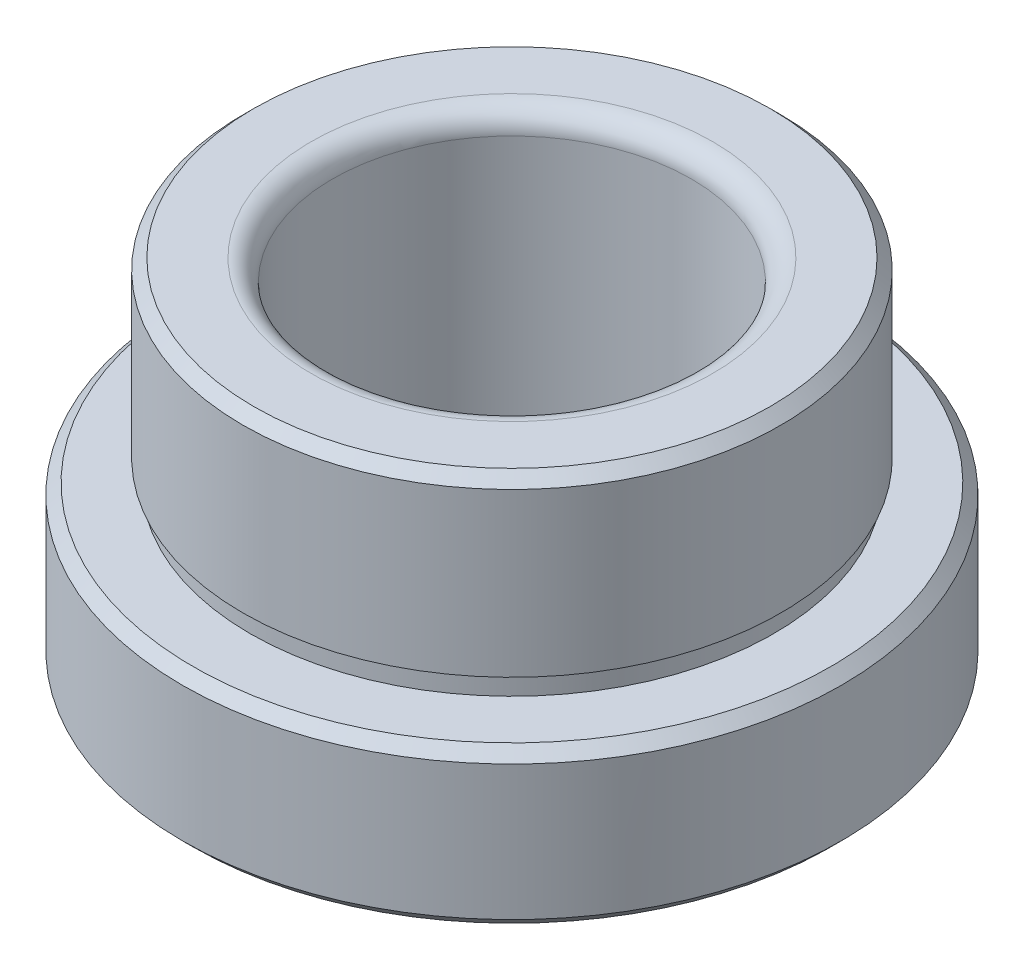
ISO-10303-21;
HEADER;
FILE_DESCRIPTION(('STEP AP214'),'2;1');
FILE_NAME('part.step','',(''),(''),'','','');
FILE_SCHEMA(('AUTOMOTIVE_DESIGN { 1 0 10303 214 1 1 1 1 }'));
ENDSEC;
DATA;
#1=APPLICATION_CONTEXT('core data for automotive mechanical design processes');
#2=APPLICATION_PROTOCOL_DEFINITION('international standard','automotive_design',2000,#1);
#3=PRODUCT_CONTEXT('',#1,'mechanical');
#4=PRODUCT('Part','Part','',(#3));
#5=PRODUCT_RELATED_PRODUCT_CATEGORY('part','',(#4));
#6=PRODUCT_DEFINITION_FORMATION('','',#4);
#7=PRODUCT_DEFINITION_CONTEXT('part definition',#1,'design');
#8=PRODUCT_DEFINITION('design','',#6,#7);
#9=PRODUCT_DEFINITION_SHAPE('','',#8);
#10=(LENGTH_UNIT() NAMED_UNIT(*) SI_UNIT(.MILLI.,.METRE.));
#11=(NAMED_UNIT(*) PLANE_ANGLE_UNIT() SI_UNIT($,.RADIAN.));
#12=(NAMED_UNIT(*) SI_UNIT($,.STERADIAN.) SOLID_ANGLE_UNIT());
#13=UNCERTAINTY_MEASURE_WITH_UNIT(LENGTH_MEASURE(1.E-05),#10,'distance_accuracy_value','');
#14=(GEOMETRIC_REPRESENTATION_CONTEXT(3) GLOBAL_UNCERTAINTY_ASSIGNED_CONTEXT((#13)) GLOBAL_UNIT_ASSIGNED_CONTEXT((#10,
#11,#12)) REPRESENTATION_CONTEXT('',''));
#15=CARTESIAN_POINT('',(0.,0.,0.));
#16=DIRECTION('',(0.,0.,1.));
#17=DIRECTION('',(1.,0.,0.));
#18=AXIS2_PLACEMENT_3D('',#15,#16,#17);
#19=CARTESIAN_POINT('',(6.35762,12.446,0.));
#20=DIRECTION('',(0.,-1.,0.));
#21=DIRECTION('',(0.,0.,-1.));
#22=AXIS2_PLACEMENT_3D('',#19,#20,#21);
#23=PLANE('',#22);
#24=CARTESIAN_POINT('',(0.,12.446,0.));
#25=DIRECTION('',(0.,-1.,0.));
#26=DIRECTION('',(0.,0.,-1.));
#27=AXIS2_PLACEMENT_3D('',#24,#25,#26);
#28=CIRCLE('',#27,9.15289);
#29=CARTESIAN_POINT('',(0.,12.446,-9.15289));
#30=VERTEX_POINT('',#29);
#31=EDGE_CURVE('E39',#30,#30,#28,.F.);
#32=ORIENTED_EDGE('',*,*,#31,.T.);
#33=EDGE_LOOP('',(#32));
#34=FACE_BOUND('',#33,.T.);
#35=CARTESIAN_POINT('',(0.,12.446,0.));
#36=DIRECTION('',(0.,-1.,0.));
#37=DIRECTION('',(0.,0.,-1.));
#38=AXIS2_PLACEMENT_3D('',#35,#36,#37);
#39=CIRCLE('',#38,7.11962);
#40=CARTESIAN_POINT('',(0.,12.446,-7.11962));
#41=VERTEX_POINT('',#40);
#42=EDGE_CURVE('E64',#41,#41,#39,.T.);
#43=ORIENTED_EDGE('',*,*,#42,.T.);
#44=EDGE_LOOP('',(#43));
#45=FACE_BOUND('',#44,.T.);
#46=ADVANCED_FACE('F32',(#34,#45),#23,.F.);
#47=CARTESIAN_POINT('',(0.,10.5189532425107,0.));
#48=DIRECTION('',(0.,1.,0.));
#49=DIRECTION('',(0.,0.,1.));
#50=AXIS2_PLACEMENT_3D('',#47,#48,#49);
#51=CYLINDRICAL_SURFACE('',#50,9.53389);
#52=CARTESIAN_POINT('',(0.,12.065,0.));
#53=DIRECTION('',(0.,-1.,0.));
#54=DIRECTION('',(0.,0.,-1.));
#55=AXIS2_PLACEMENT_3D('',#52,#53,#54);
#56=CIRCLE('',#55,9.53389);
#57=CARTESIAN_POINT('',(0.,12.065,-9.53389));
#58=VERTEX_POINT('',#57);
#59=EDGE_CURVE('E10',#58,#58,#56,.T.);
#60=ORIENTED_EDGE('',*,*,#59,.T.);
#61=EDGE_LOOP('',(#60));
#62=FACE_BOUND('',#61,.T.);
#63=CARTESIAN_POINT('',(0.,6.2992,0.));
#64=DIRECTION('',(0.,1.,0.));
#65=DIRECTION('',(0.,0.,1.));
#66=AXIS2_PLACEMENT_3D('',#63,#64,#65);
#67=CIRCLE('',#66,9.53389);
#68=CARTESIAN_POINT('',(0.,6.2992,9.53389));
#69=VERTEX_POINT('',#68);
#70=EDGE_CURVE('E70',#69,#69,#67,.T.);
#71=ORIENTED_EDGE('',*,*,#70,.T.);
#72=EDGE_LOOP('',(#71));
#73=FACE_BOUND('',#72,.T.);
#74=ADVANCED_FACE('F98',(#62,#73),#51,.T.);
#75=CARTESIAN_POINT('',(9.53389,6.2992,0.));
#76=DIRECTION('',(0.,1.,0.));
#77=DIRECTION('',(0.,0.,1.));
#78=AXIS2_PLACEMENT_3D('',#75,#76,#77);
#79=PLANE('',#78);
#80=ORIENTED_EDGE('',*,*,#70,.F.);
#81=EDGE_LOOP('',(#80));
#82=FACE_BOUND('',#81,.T.);
#83=CARTESIAN_POINT('',(0.,6.2992,0.));
#84=DIRECTION('',(0.,1.,0.));
#85=DIRECTION('',(0.,0.,1.));
#86=AXIS2_PLACEMENT_3D('',#83,#84,#85);
#87=CIRCLE('',#86,9.27989);
#88=CARTESIAN_POINT('',(0.,6.2992,9.27989));
#89=VERTEX_POINT('',#88);
#90=EDGE_CURVE('E73',#89,#89,#87,.T.);
#91=ORIENTED_EDGE('',*,*,#90,.T.);
#92=EDGE_LOOP('',(#91));
#93=FACE_BOUND('',#92,.T.);
#94=ADVANCED_FACE('F94',(#82,#93),#79,.F.);
#95=CARTESIAN_POINT('',(0.,10.5189532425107,0.));
#96=DIRECTION('',(0.,1.,0.));
#97=DIRECTION('',(0.,0.,1.));
#98=AXIS2_PLACEMENT_3D('',#95,#96,#97);
#99=CYLINDRICAL_SURFACE('',#98,9.27989);
#100=ORIENTED_EDGE('',*,*,#90,.F.);
#101=EDGE_LOOP('',(#100));
#102=FACE_BOUND('',#101,.T.);
#103=CARTESIAN_POINT('',(0.,5.5372,0.));
#104=DIRECTION('',(0.,1.,0.));
#105=DIRECTION('',(0.,0.,1.));
#106=AXIS2_PLACEMENT_3D('',#103,#104,#105);
#107=CIRCLE('',#106,9.27989);
#108=CARTESIAN_POINT('',(0.,5.5372,9.27989));
#109=VERTEX_POINT('',#108);
#110=EDGE_CURVE('E76',#109,#109,#107,.T.);
#111=ORIENTED_EDGE('',*,*,#110,.T.);
#112=EDGE_LOOP('',(#111));
#113=FACE_BOUND('',#112,.T.);
#114=ADVANCED_FACE('F80',(#102,#113),#99,.T.);
#115=CARTESIAN_POINT('',(9.27989,5.5372,0.));
#116=DIRECTION('',(0.,-1.,0.));
#117=DIRECTION('',(0.,0.,-1.));
#118=AXIS2_PLACEMENT_3D('',#115,#116,#117);
#119=PLANE('',#118);
#120=CARTESIAN_POINT('',(0.,5.5372,0.));
#121=DIRECTION('',(0.,-1.,0.));
#122=DIRECTION('',(0.,0.,-1.));
#123=AXIS2_PLACEMENT_3D('',#120,#121,#122);
#124=CIRCLE('',#123,11.303);
#125=CARTESIAN_POINT('',(0.,5.5372,-11.303));
#126=VERTEX_POINT('',#125);
#127=EDGE_CURVE('E43',#126,#126,#124,.F.);
#128=ORIENTED_EDGE('',*,*,#127,.T.);
#129=EDGE_LOOP('',(#128));
#130=FACE_BOUND('',#129,.T.);
#131=ORIENTED_EDGE('',*,*,#110,.F.);
#132=EDGE_LOOP('',(#131));
#133=FACE_BOUND('',#132,.T.);
#134=ADVANCED_FACE('F82',(#130,#133),#119,.F.);
#135=CARTESIAN_POINT('',(0.,10.5189532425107,0.));
#136=DIRECTION('',(0.,1.,0.));
#137=DIRECTION('',(0.,0.,1.));
#138=AXIS2_PLACEMENT_3D('',#135,#136,#137);
#139=CYLINDRICAL_SURFACE('',#138,11.684);
#140=CARTESIAN_POINT('',(0.,0.380999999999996,0.));
#141=DIRECTION('',(0.,1.,0.));
#142=DIRECTION('',(0.,0.,1.));
#143=AXIS2_PLACEMENT_3D('',#140,#141,#142);
#144=CIRCLE('',#143,11.684);
#145=CARTESIAN_POINT('',(0.,0.380999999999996,11.684));
#146=VERTEX_POINT('',#145);
#147=EDGE_CURVE('E52',#146,#146,#144,.T.);
#148=ORIENTED_EDGE('',*,*,#147,.T.);
#149=EDGE_LOOP('',(#148));
#150=FACE_BOUND('',#149,.T.);
#151=CARTESIAN_POINT('',(0.,5.15619999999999,0.));
#152=DIRECTION('',(0.,-1.,0.));
#153=DIRECTION('',(0.,0.,-1.));
#154=AXIS2_PLACEMENT_3D('',#151,#152,#153);
#155=CIRCLE('',#154,11.684);
#156=CARTESIAN_POINT('',(0.,5.15619999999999,-11.684));
#157=VERTEX_POINT('',#156);
#158=EDGE_CURVE('E55',#157,#157,#155,.T.);
#159=ORIENTED_EDGE('',*,*,#158,.T.);
#160=EDGE_LOOP('',(#159));
#161=FACE_BOUND('',#160,.T.);
#162=ADVANCED_FACE('F84',(#150,#161),#139,.T.);
#163=CARTESIAN_POINT('',(11.684,0.,0.));
#164=DIRECTION('',(0.,1.,0.));
#165=DIRECTION('',(0.,0.,1.));
#166=AXIS2_PLACEMENT_3D('',#163,#164,#165);
#167=PLANE('',#166);
#168=CARTESIAN_POINT('',(0.,0.,0.));
#169=DIRECTION('',(0.,1.,0.));
#170=DIRECTION('',(0.,0.,1.));
#171=AXIS2_PLACEMENT_3D('',#168,#169,#170);
#172=CIRCLE('',#171,11.303);
#173=CARTESIAN_POINT('',(0.,0.,11.303));
#174=VERTEX_POINT('',#173);
#175=EDGE_CURVE('E47',#174,#174,#172,.F.);
#176=ORIENTED_EDGE('',*,*,#175,.T.);
#177=EDGE_LOOP('',(#176));
#178=FACE_BOUND('',#177,.T.);
#179=CARTESIAN_POINT('',(0.,0.,0.));
#180=DIRECTION('',(0.,1.,0.));
#181=DIRECTION('',(0.,0.,1.));
#182=AXIS2_PLACEMENT_3D('',#179,#180,#181);
#183=CIRCLE('',#182,7.11962);
#184=CARTESIAN_POINT('',(0.,0.,-7.11962));
#185=VERTEX_POINT('',#184);
#186=EDGE_CURVE('E61',#185,#185,#183,.T.);
#187=ORIENTED_EDGE('',*,*,#186,.T.);
#188=EDGE_LOOP('',(#187));
#189=FACE_BOUND('',#188,.T.);
#190=ADVANCED_FACE('F91',(#178,#189),#167,.F.);
#191=CARTESIAN_POINT('',(0.,10.5189532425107,0.));
#192=DIRECTION('',(0.,1.,0.));
#193=DIRECTION('',(0.,0.,1.));
#194=AXIS2_PLACEMENT_3D('',#191,#192,#193);
#195=CYLINDRICAL_SURFACE('',#194,6.35762);
#196=CARTESIAN_POINT('',(0.,0.762000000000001,0.));
#197=DIRECTION('',(0.,1.,0.));
#198=DIRECTION('',(0.,0.,1.));
#199=AXIS2_PLACEMENT_3D('',#196,#197,#198);
#200=CIRCLE('',#199,6.35762);
#201=CARTESIAN_POINT('',(0.,0.762,-6.35762));
#202=VERTEX_POINT('',#201);
#203=EDGE_CURVE('E58',#202,#202,#200,.F.);
#204=ORIENTED_EDGE('',*,*,#203,.T.);
#205=EDGE_LOOP('',(#204));
#206=FACE_BOUND('',#205,.T.);
#207=CARTESIAN_POINT('',(0.,11.684,0.));
#208=DIRECTION('',(0.,-1.,0.));
#209=DIRECTION('',(0.,0.,-1.));
#210=AXIS2_PLACEMENT_3D('',#207,#208,#209);
#211=CIRCLE('',#210,6.35762);
#212=CARTESIAN_POINT('',(0.,11.684,-6.35762));
#213=VERTEX_POINT('',#212);
#214=EDGE_CURVE('E67',#213,#213,#211,.F.);
#215=ORIENTED_EDGE('',*,*,#214,.T.);
#216=EDGE_LOOP('',(#215));
#217=FACE_BOUND('',#216,.T.);
#218=ADVANCED_FACE('F111',(#206,#217),#195,.F.);
#219=CARTESIAN_POINT('',(0.,11.684,0.));
#220=DIRECTION('',(0.,-1.,0.));
#221=DIRECTION('',(0.,0.,-1.));
#222=AXIS2_PLACEMENT_3D('',#219,#220,#221);
#223=TOROIDAL_SURFACE('',#222,7.11962,0.762);
#224=ORIENTED_EDGE('',*,*,#42,.F.);
#225=EDGE_LOOP('',(#224));
#226=FACE_BOUND('',#225,.T.);
#227=ORIENTED_EDGE('',*,*,#214,.F.);
#228=EDGE_LOOP('',(#227));
#229=FACE_BOUND('',#228,.T.);
#230=ADVANCED_FACE('F107',(#226,#229),#223,.T.);
#231=CARTESIAN_POINT('',(0.,0.,0.));
#232=DIRECTION('',(0.,-1.,0.));
#233=DIRECTION('',(0.,0.,-1.));
#234=AXIS2_PLACEMENT_3D('',#231,#232,#233);
#235=CONICAL_SURFACE('',#234,7.11962,0.785398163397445);
#236=CARTESIAN_POINT('',(0.,0.762,-6.35762));
#237=CARTESIAN_POINT('',(0.,0.7540625,-6.3655575));
#238=CARTESIAN_POINT('',(0.,0.746125,-6.373495));
#239=CARTESIAN_POINT('',(0.,0.73025,-6.38937));
#240=CARTESIAN_POINT('',(0.,0.7223125,-6.3973075));
#241=CARTESIAN_POINT('',(0.,0.7064375,-6.4131825));
#242=CARTESIAN_POINT('',(0.,0.6985,-6.42112));
#243=CARTESIAN_POINT('',(0.,0.682625,-6.436995));
#244=CARTESIAN_POINT('',(0.,0.6746875,-6.4449325));
#245=CARTESIAN_POINT('',(0.,0.6588125,-6.4608075));
#246=CARTESIAN_POINT('',(0.,0.650875,-6.468745));
#247=CARTESIAN_POINT('',(0.,0.635,-6.48462));
#248=CARTESIAN_POINT('',(0.,0.6270625,-6.4925575));
#249=CARTESIAN_POINT('',(0.,0.6111875,-6.5084325));
#250=CARTESIAN_POINT('',(0.,0.60325,-6.51637));
#251=CARTESIAN_POINT('',(0.,0.587375,-6.532245));
#252=CARTESIAN_POINT('',(0.,0.5794375,-6.5401825));
#253=CARTESIAN_POINT('',(0.,0.5635625,-6.5560575));
#254=CARTESIAN_POINT('',(0.,0.555625,-6.563995));
#255=CARTESIAN_POINT('',(0.,0.53975,-6.57987));
#256=CARTESIAN_POINT('',(0.,0.5318125,-6.5878075));
#257=CARTESIAN_POINT('',(0.,0.5159375,-6.6036825));
#258=CARTESIAN_POINT('',(0.,0.508,-6.61162));
#259=CARTESIAN_POINT('',(0.,0.492125,-6.627495));
#260=CARTESIAN_POINT('',(0.,0.4841875,-6.6354325));
#261=CARTESIAN_POINT('',(0.,0.4683125,-6.6513075));
#262=CARTESIAN_POINT('',(0.,0.460375,-6.659245));
#263=CARTESIAN_POINT('',(0.,0.4445,-6.67512));
#264=CARTESIAN_POINT('',(0.,0.4365625,-6.6830575));
#265=CARTESIAN_POINT('',(0.,0.4206875,-6.6989325));
#266=CARTESIAN_POINT('',(0.,0.41275,-6.70687));
#267=CARTESIAN_POINT('',(0.,0.396875,-6.722745));
#268=CARTESIAN_POINT('',(0.,0.3889375,-6.7306825));
#269=CARTESIAN_POINT('',(0.,0.3730625,-6.7465575));
#270=CARTESIAN_POINT('',(0.,0.365125,-6.754495));
#271=CARTESIAN_POINT('',(0.,0.34925,-6.77037));
#272=CARTESIAN_POINT('',(0.,0.3413125,-6.7783075));
#273=CARTESIAN_POINT('',(0.,0.3254375,-6.7941825));
#274=CARTESIAN_POINT('',(0.,0.3175,-6.80212));
#275=CARTESIAN_POINT('',(0.,0.301625,-6.817995));
#276=CARTESIAN_POINT('',(0.,0.2936875,-6.8259325));
#277=CARTESIAN_POINT('',(0.,0.2778125,-6.8418075));
#278=CARTESIAN_POINT('',(0.,0.269875,-6.849745));
#279=CARTESIAN_POINT('',(0.,0.254,-6.86562));
#280=CARTESIAN_POINT('',(0.,0.2460625,-6.8735575));
#281=CARTESIAN_POINT('',(0.,0.2301875,-6.8894325));
#282=CARTESIAN_POINT('',(0.,0.22225,-6.89737));
#283=CARTESIAN_POINT('',(0.,0.206375,-6.913245));
#284=CARTESIAN_POINT('',(0.,0.1984375,-6.9211825));
#285=CARTESIAN_POINT('',(0.,0.1825625,-6.9370575));
#286=CARTESIAN_POINT('',(0.,0.174625,-6.944995));
#287=CARTESIAN_POINT('',(0.,0.15875,-6.96087));
#288=CARTESIAN_POINT('',(0.,0.1508125,-6.9688075));
#289=CARTESIAN_POINT('',(0.,0.1349375,-6.9846825));
#290=CARTESIAN_POINT('',(0.,0.127,-6.99262));
#291=CARTESIAN_POINT('',(0.,0.111125,-7.008495));
#292=CARTESIAN_POINT('',(0.,0.1031875,-7.0164325));
#293=CARTESIAN_POINT('',(0.,0.0873124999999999,-7.0323075));
#294=CARTESIAN_POINT('',(0.,0.0793749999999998,-7.040245));
#295=CARTESIAN_POINT('',(0.,0.0634999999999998,-7.05612));
#296=CARTESIAN_POINT('',(0.,0.0555624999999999,-7.0640575));
#297=CARTESIAN_POINT('',(0.,0.0396874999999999,-7.0799325));
#298=CARTESIAN_POINT('',(0.,0.0317499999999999,-7.08787));
#299=CARTESIAN_POINT('',(0.,0.0158749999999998,-7.103745));
#300=CARTESIAN_POINT('',(0.,0.00793749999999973,-7.1116825));
#301=CARTESIAN_POINT('',(0.,0.,-7.11962));
#302=B_SPLINE_CURVE_WITH_KNOTS('',3,(#236,#237,#238,#239,#240,#241,#242,#243,#244,#245,#246,
#247,#248,#249,#250,#251,#252,#253,#254,#255,#256,#257,#258,#259,#260,#261,#262,#263,#264,#265,
#266,#267,#268,#269,#270,#271,#272,#273,#274,#275,#276,#277,#278,#279,#280,#281,#282,#283,#284,
#285,#286,#287,#288,#289,#290,#291,#292,#293,#294,#295,#296,#297,#298,#299,#300,#301),
.UNSPECIFIED.,.F.,.F.,(4,2,2,2,2,2,2,2,2,2,2,2,2,2,2,2,2,2,2,2,2,2,2,2,2,2,2,2,2,2,2,2,4),(0.,
0.033675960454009,0.0673519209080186,0.101027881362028,0.134703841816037,0.168379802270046,
0.202055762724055,0.235731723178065,0.269407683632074,0.303083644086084,0.336759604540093,
0.370435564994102,0.404111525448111,0.43778748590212,0.471463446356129,0.505139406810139,
0.538815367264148,0.572491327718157,0.606167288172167,0.639843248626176,0.673519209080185,
0.707195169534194,0.740871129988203,0.774547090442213,0.808223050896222,0.841899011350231,
0.87557497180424,0.909250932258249,0.942926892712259,0.976602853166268,1.01027881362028,
1.04395477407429,1.0776307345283),.UNSPECIFIED.);
#303=EDGE_CURVE('BSEAM110',#202,#185,#302,.T.);
#304=ORIENTED_EDGE('',*,*,#203,.F.);
#305=ORIENTED_EDGE('',*,*,#186,.F.);
#306=ORIENTED_EDGE('',*,*,#303,.T.);
#307=ORIENTED_EDGE('',*,*,#303,.F.);
#308=EDGE_LOOP('',(#304,#306,#305,#307));
#309=FACE_BOUND('',#308,.T.);
#310=ADVANCED_FACE('F110',(#309),#235,.F.);
#311=CARTESIAN_POINT('',(0.,0.380999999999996,0.));
#312=DIRECTION('',(0.,1.,0.));
#313=DIRECTION('',(0.,0.,1.));
#314=AXIS2_PLACEMENT_3D('',#311,#312,#313);
#315=CONICAL_SURFACE('',#314,11.684,0.785398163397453);
#316=ORIENTED_EDGE('',*,*,#175,.F.);
#317=EDGE_LOOP('',(#316));
#318=FACE_BOUND('',#317,.T.);
#319=ORIENTED_EDGE('',*,*,#147,.F.);
#320=EDGE_LOOP('',(#319));
#321=FACE_BOUND('',#320,.T.);
#322=ADVANCED_FACE('F115',(#318,#321),#315,.T.);
#323=CARTESIAN_POINT('',(0.,5.5372,0.));
#324=DIRECTION('',(0.,-1.,0.));
#325=DIRECTION('',(0.,0.,-1.));
#326=AXIS2_PLACEMENT_3D('',#323,#324,#325);
#327=CONICAL_SURFACE('',#326,11.303,0.785398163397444);
#328=CARTESIAN_POINT('',(0.,5.15619999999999,-11.684));
#329=CARTESIAN_POINT('',(0.,5.16016874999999,-11.68003125));
#330=CARTESIAN_POINT('',(0.,5.16413749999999,-11.6760625));
#331=CARTESIAN_POINT('',(0.,5.17207499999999,-11.668125));
#332=CARTESIAN_POINT('',(0.,5.17604374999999,-11.66415625));
#333=CARTESIAN_POINT('',(0.,5.18398124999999,-11.65621875));
#334=CARTESIAN_POINT('',(0.,5.18795,-11.65225));
#335=CARTESIAN_POINT('',(0.,5.1958875,-11.6443125));
#336=CARTESIAN_POINT('',(0.,5.19985624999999,-11.64034375));
#337=CARTESIAN_POINT('',(0.,5.20779374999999,-11.63240625));
#338=CARTESIAN_POINT('',(0.,5.21176249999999,-11.6284375));
#339=CARTESIAN_POINT('',(0.,5.21969999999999,-11.6205));
#340=CARTESIAN_POINT('',(0.,5.22366875,-11.61653125));
#341=CARTESIAN_POINT('',(0.,5.23160625,-11.60859375));
#342=CARTESIAN_POINT('',(0.,5.235575,-11.604625));
#343=CARTESIAN_POINT('',(0.,5.2435125,-11.5966875));
#344=CARTESIAN_POINT('',(0.,5.24748124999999,-11.59271875));
#345=CARTESIAN_POINT('',(0.,5.25541875,-11.58478125));
#346=CARTESIAN_POINT('',(0.,5.2593875,-11.5808125));
#347=CARTESIAN_POINT('',(0.,5.267325,-11.572875));
#348=CARTESIAN_POINT('',(0.,5.27129375,-11.56890625));
#349=CARTESIAN_POINT('',(0.,5.27923125,-11.56096875));
#350=CARTESIAN_POINT('',(0.,5.2832,-11.557));
#351=CARTESIAN_POINT('',(0.,5.2911375,-11.5490625));
#352=CARTESIAN_POINT('',(0.,5.29510625,-11.54509375));
#353=CARTESIAN_POINT('',(0.,5.30304375,-11.53715625));
#354=CARTESIAN_POINT('',(0.,5.3070125,-11.5331875));
#355=CARTESIAN_POINT('',(0.,5.31495,-11.52525));
#356=CARTESIAN_POINT('',(0.,5.31891875,-11.52128125));
#357=CARTESIAN_POINT('',(0.,5.32685625,-11.51334375));
#358=CARTESIAN_POINT('',(0.,5.330825,-11.509375));
#359=CARTESIAN_POINT('',(0.,5.3387625,-11.5014375));
#360=CARTESIAN_POINT('',(0.,5.34273125,-11.49746875));
#361=CARTESIAN_POINT('',(0.,5.35066875,-11.48953125));
#362=CARTESIAN_POINT('',(0.,5.3546375,-11.4855625));
#363=CARTESIAN_POINT('',(0.,5.362575,-11.477625));
#364=CARTESIAN_POINT('',(0.,5.36654375,-11.47365625));
#365=CARTESIAN_POINT('',(0.,5.37448125,-11.46571875));
#366=CARTESIAN_POINT('',(0.,5.37845,-11.46175));
#367=CARTESIAN_POINT('',(0.,5.3863875,-11.4538125));
#368=CARTESIAN_POINT('',(0.,5.39035625,-11.44984375));
#369=CARTESIAN_POINT('',(0.,5.39829375,-11.44190625));
#370=CARTESIAN_POINT('',(0.,5.4022625,-11.4379375));
#371=CARTESIAN_POINT('',(0.,5.4102,-11.43));
#372=CARTESIAN_POINT('',(0.,5.41416875,-11.42603125));
#373=CARTESIAN_POINT('',(0.,5.42210625,-11.41809375));
#374=CARTESIAN_POINT('',(0.,5.426075,-11.414125));
#375=CARTESIAN_POINT('',(0.,5.4340125,-11.4061875));
#376=CARTESIAN_POINT('',(0.,5.43798125,-11.40221875));
#377=CARTESIAN_POINT('',(0.,5.44591875,-11.39428125));
#378=CARTESIAN_POINT('',(0.,5.4498875,-11.3903125));
#379=CARTESIAN_POINT('',(0.,5.457825,-11.382375));
#380=CARTESIAN_POINT('',(0.,5.46179375,-11.37840625));
#381=CARTESIAN_POINT('',(0.,5.46973125,-11.37046875));
#382=CARTESIAN_POINT('',(0.,5.4737,-11.3665));
#383=CARTESIAN_POINT('',(0.,5.4816375,-11.3585625));
#384=CARTESIAN_POINT('',(0.,5.48560625,-11.35459375));
#385=CARTESIAN_POINT('',(0.,5.49354375,-11.34665625));
#386=CARTESIAN_POINT('',(0.,5.4975125,-11.3426875));
#387=CARTESIAN_POINT('',(0.,5.50545,-11.33475));
#388=CARTESIAN_POINT('',(0.,5.50941875,-11.33078125));
#389=CARTESIAN_POINT('',(0.,5.51735625,-11.32284375));
#390=CARTESIAN_POINT('',(0.,5.521325,-11.318875));
#391=CARTESIAN_POINT('',(0.,5.5292625,-11.3109375));
#392=CARTESIAN_POINT('',(0.,5.53323125,-11.30696875));
#393=CARTESIAN_POINT('',(0.,5.5372,-11.303));
#394=B_SPLINE_CURVE_WITH_KNOTS('',3,(#328,#329,#330,#331,#332,#333,#334,#335,#336,#337,#338,
#339,#340,#341,#342,#343,#344,#345,#346,#347,#348,#349,#350,#351,#352,#353,#354,#355,#356,#357,
#358,#359,#360,#361,#362,#363,#364,#365,#366,#367,#368,#369,#370,#371,#372,#373,#374,#375,#376,
#377,#378,#379,#380,#381,#382,#383,#384,#385,#386,#387,#388,#389,#390,#391,#392,#393),
.UNSPECIFIED.,.F.,.F.,(4,2,2,2,2,2,2,2,2,2,2,2,2,2,2,2,2,2,2,2,2,2,2,2,2,2,2,2,2,2,2,2,4),(0.,
0.0168379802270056,0.0336759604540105,0.0505139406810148,0.0673519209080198,0.0841899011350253,
0.101027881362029,0.117865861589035,0.13470384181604,0.151541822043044,0.168379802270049,
0.185217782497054,0.202055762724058,0.218893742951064,0.235731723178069,0.252569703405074,
0.269407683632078,0.286245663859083,0.303083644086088,0.319921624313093,0.336759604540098,
0.353597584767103,0.370435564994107,0.387273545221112,0.404111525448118,0.420949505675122,
0.437787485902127,0.454625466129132,0.471463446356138,0.488301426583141,0.505139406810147,
0.521977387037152,0.538815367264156),.UNSPECIFIED.);
#395=EDGE_CURVE('BSEAM118',#157,#126,#394,.T.);
#396=ORIENTED_EDGE('',*,*,#158,.F.);
#397=ORIENTED_EDGE('',*,*,#127,.F.);
#398=ORIENTED_EDGE('',*,*,#395,.T.);
#399=ORIENTED_EDGE('',*,*,#395,.F.);
#400=EDGE_LOOP('',(#396,#398,#397,#399));
#401=FACE_BOUND('',#400,.T.);
#402=ADVANCED_FACE('F118',(#401),#327,.T.);
#403=CARTESIAN_POINT('',(0.,12.446,0.));
#404=DIRECTION('',(0.,-1.,0.));
#405=DIRECTION('',(0.,0.,-1.));
#406=AXIS2_PLACEMENT_3D('',#403,#404,#405);
#407=CONICAL_SURFACE('',#406,9.15289,0.785398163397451);
#408=ORIENTED_EDGE('',*,*,#59,.F.);
#409=EDGE_LOOP('',(#408));
#410=FACE_BOUND('',#409,.T.);
#411=ORIENTED_EDGE('',*,*,#31,.F.);
#412=EDGE_LOOP('',(#411));
#413=FACE_BOUND('',#412,.T.);
#414=ADVANCED_FACE('F34',(#410,#413),#407,.T.);
#415=CLOSED_SHELL('',(#46,#74,#94,#114,#134,#162,#190,#218,#230,#310,#322,#402,#414));
#416=MANIFOLD_SOLID_BREP('B2',#415);
#417=ADVANCED_BREP_SHAPE_REPRESENTATION('',(#18,#416),#14);
#418=SHAPE_DEFINITION_REPRESENTATION(#9,#417);
ENDSEC;
END-ISO-10303-21;
